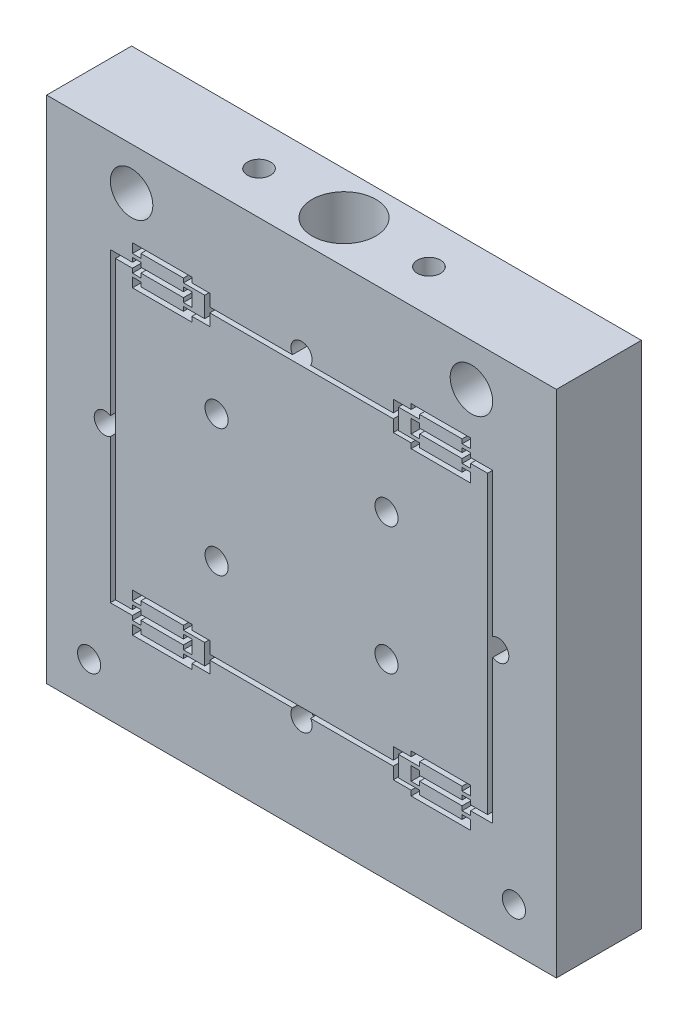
from build123d import *

# Parameters (mm, degrees)
SKETCH1_W                      = 76.2
SKETCH1_H                      = 76.2
BOSS_EXTRUDE1_DEPTH            = 6.35
CUT_EXTRUDE1_REACH             = 57.358
CUT_EXTRUDE2_REACH             = 57.358
F_1_4_0_25_DIAMETER_HOLE1_D    = 6.35
F_8_32_TAPPED_HOLE1_D          = 3.4544
SKETCH12_R                     = 3.81
CUT_EXTRUDE7_DEPTH             = 20.828
F_8_32_TAPPED_HOLE2_AT_2_COUNT = 2
F_8_32_TAPPED_HOLE2_AT_2_PITCH = 25.4
SKETCH16_R                     = 1.5875
CUT_EXTRUDE8_DEPTH             = 56.358016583
SKETCH17_R                     = 4.7625
CUT_EXTRUDE9_DEPTH             = 12.7


with BuildPart() as part:
    # Sketch1 → Boss-Extrude1 (new, symmetric)
    with BuildSketch(Plane.XY):
        Rectangle(SKETCH1_W, SKETCH1_H)
    extrude(amount=BOSS_EXTRUDE1_DEPTH, both=True)

    # Sketch2 → Cut-Extrude1 (cut, up to next)
    with BuildSketch(Plane.XY.offset(6.35), mode=Mode.PRIVATE) as cut_extrude1_sk1:
        Polygon((16.383, 23.495), (17.653, 23.495), (17.653, 22.86), (24.003, 22.86), (24.003, 23.495), (25.273, 23.495), (25.273, 22.86), (28.575, 22.86), (28.575, -22.86), (25.273, -22.86), (25.273, -23.495), (24.003, -23.495), (24.003, -22.86), (17.653, -22.86), (17.653, -23.495), (16.383, -23.495), (16.383, -21.463), (17.653, -21.463), (17.653, -22.098), (24.003, -22.098), (24.003, -21.463), (25.273, -21.463), (25.273, -22.098), (27.813, -22.098), (27.813, 22.098), (25.273, 22.098), (25.273, 21.463), (24.003, 21.463), (24.003, 22.098), (17.653, 22.098), (17.653, 21.463), (16.383, 21.463), align=None)
    cut_extrude1_tool1 = extrude(cut_extrude1_sk1.sketch, amount=-CUT_EXTRUDE1_REACH, mode=Mode.PRIVATE) & part.part
    cut_extrude1 = cut_extrude1_tool1.solids().sort_by_distance((17.018, 23.009541, 6.35))[0]
    add(cut_extrude1, mode=Mode.SUBTRACT)

    # Mirror1: Cut-Extrude1 across plane
    add(cut_extrude1.mirror(Plane(origin=(0, 0, 0), x_dir=(0, 0, 1), z_dir=(1, 0, 0))), mode=Mode.SUBTRACT)

    # Sketch3 → Cut-Extrude2 (cut, up to next)
    with BuildSketch(Plane.XY.offset(6.35), mode=Mode.PRIVATE) as cut_extrude2_sk1:
        Polygon((25.273, 20.955), (25.273, 19.558), (16.383, 19.558), (16.383, 20.32), (13.716, 20.32), (13.716, 22.098), (-13.716, 22.098), (-13.716, 20.32), (-16.383, 20.32), (-16.383, 19.558), (-25.273, 19.558), (-25.273, 20.955), (-24.003, 20.955), (-24.003, 20.32), (-17.653, 20.32), (-17.653, 20.955), (-14.478, 20.955), (-14.478, 24.003), (-17.653, 24.003), (-17.653, 24.638), (-24.003, 24.638), (-24.003, 24.003), (-25.273, 24.003), (-25.273, 25.4), (-16.383, 25.4), (-16.383, 24.638), (-13.716, 24.638), (-13.716, 22.86), (13.716, 22.86), (13.716, 24.638), (16.383, 24.638), (16.383, 25.4), (25.273, 25.4), (25.273, 24.003), (24.003, 24.003), (24.003, 24.638), (17.653, 24.638), (17.653, 24.003), (14.478, 24.003), (14.478, 20.955), (17.653, 20.955), (17.653, 20.32), (24.003, 20.32), (24.003, 20.955), align=None)
    cut_extrude2_tool1 = extrude(cut_extrude2_sk1.sketch, amount=-CUT_EXTRUDE2_REACH, mode=Mode.PRIVATE) & part.part
    cut_extrude2 = cut_extrude2_tool1.solids().sort_by_distance((0, 22.479, 6.35))[0]
    add(cut_extrude2, mode=Mode.SUBTRACT)

    # Mirror2: Cut-Extrude2 across plane
    add(cut_extrude2.mirror(Plane.ZX), mode=Mode.SUBTRACT)

    # 1_4 _0.25_ Diameter Hole1 (through all)
    with Locations(Plane.XY.offset(6.35)):
        with Locations((-25.4, 31.75), (25.4, 31.75)):
            Hole(F_1_4_0_25_DIAMETER_HOLE1_D / 2)

    # 8-32 Tapped Hole1 (through all)
    with Locations(Plane.XY.offset(6.35)):
        with Locations((-12.7, 9.525), (12.7, 9.525), (12.7, -9.525), (-12.7, -9.525), (-31.75, -31.75), (31.75, -31.75)):
            Hole(F_8_32_TAPPED_HOLE1_D / 2)

    # Sketch12 → Cut-Extrude7 (cut)
    with BuildSketch(Plane(origin=(0, 38.1, 0), x_dir=(1, 0, 0), z_dir=(0, 1, 0))):
        with Locations(Location((0, 0, 0), (0, 0, 270))):
            Circle(SKETCH12_R)
    cut_extrude7 = extrude(amount=-CUT_EXTRUDE7_DEPTH, mode=Mode.SUBTRACT)

    # Sketch14 → 8-32 Tapped Hole2 (revolve, cut)
    with BuildSketch(Plane(origin=(-12.7, 38.1, 0), x_dir=(0, 0, 1), z_dir=(1, 0, 0))):
        Polygon((0, 0), (0, 11.197806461), (1.7272, 10.16), (1.7272, 0), align=None)
    f_8_32_tapped_hole2 = revolve(axis=Axis((-12.7, 44.45, 0), (0, -1, 0)), mode=Mode.SUBTRACT)

    # 8-32 Tapped Hole2 at 2: 8-32 Tapped Hole2 ×2
    with Locations(*[(i * F_8_32_TAPPED_HOLE2_AT_2_PITCH, 0, 0) for i in range(1, F_8_32_TAPPED_HOLE2_AT_2_COUNT)]):
        add(f_8_32_tapped_hole2, mode=Mode.SUBTRACT)

    # Mirror4: Cut-Extrude7, 8-32 Tapped Hole2 across plane
    add(cut_extrude7.mirror(Plane.ZX), mode=Mode.SUBTRACT)
    add(f_8_32_tapped_hole2.mirror(Plane.ZX), mode=Mode.SUBTRACT)

    # Mirror4 copy 1 sketch → Mirror4 copy 1 (revolve, cut)
    with BuildSketch(Plane(origin=(12.7, -38.1, 0), x_dir=(0, 0, 1), z_dir=(1, 0, 0))):
        Polygon((0, 0), (0, -11.197806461), (1.7272, -10.16), (1.7272, 0), align=None)
    revolve(axis=Axis((12.7, -44.45, 0), (0, -1, 0)), mode=Mode.SUBTRACT)

    # Sketch16 → Cut-Extrude8 (cut, through all)
    with BuildSketch(Plane.XY.offset(6.35)):
        with Locations((0, 23.6855)):
            Circle(SKETCH16_R)
        with Locations((29.4005, 0)):
            Circle(SKETCH16_R)
        with Locations((-29.4005, 0)):
            Circle(SKETCH16_R)
        with Locations((0, -23.6855)):
            Circle(SKETCH16_R)
    extrude(amount=-CUT_EXTRUDE8_DEPTH, mode=Mode.SUBTRACT)

    # Sketch17 → Cut-Extrude9 (cut)
    with BuildSketch(Plane(origin=(0, 38.1, 0), x_dir=(1, 0, 0), z_dir=(0, 1, 0))):
        with Locations(Location((0, 0, 0), (0, 0, 270))):
            Circle(SKETCH17_R)
    cut_extrude9 = extrude(amount=-CUT_EXTRUDE9_DEPTH, mode=Mode.SUBTRACT)

    # Mirror5: Cut-Extrude9 across plane
    add(cut_extrude9.mirror(Plane.ZX), mode=Mode.SUBTRACT)


solid = part.part
